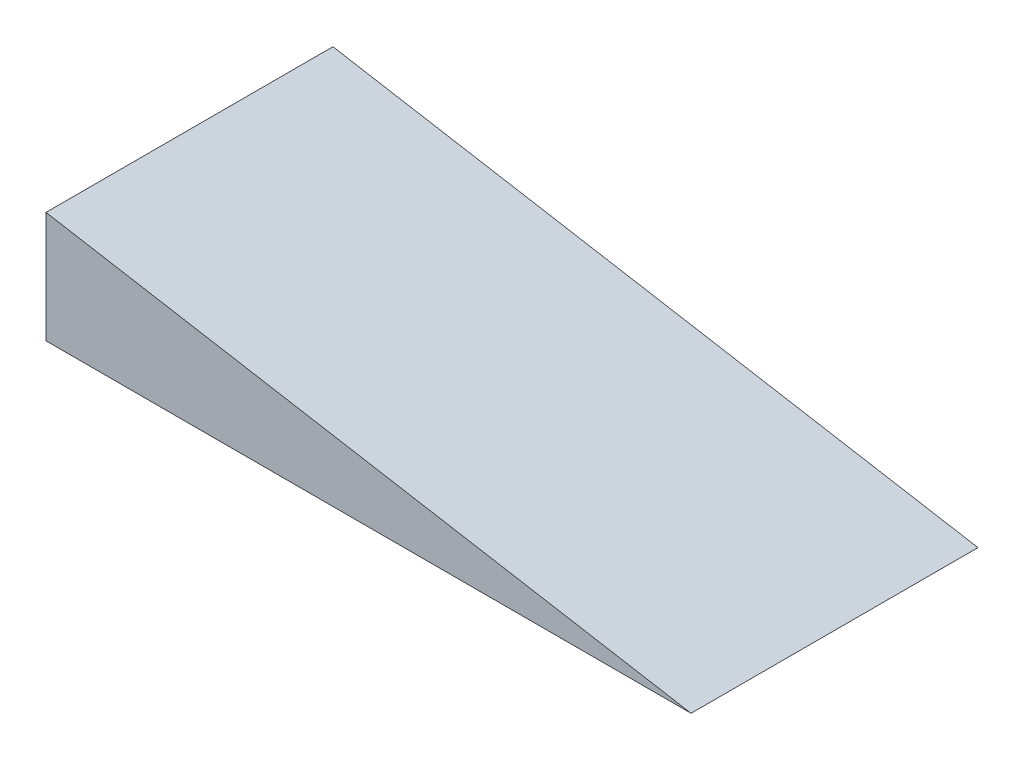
ISO-10303-21;
HEADER;
FILE_DESCRIPTION(('STEP AP214'),'2;1');
FILE_NAME('part.step','',(''),(''),'','','');
FILE_SCHEMA(('AUTOMOTIVE_DESIGN { 1 0 10303 214 1 1 1 1 }'));
ENDSEC;
DATA;
#1=APPLICATION_CONTEXT('core data for automotive mechanical design processes');
#2=APPLICATION_PROTOCOL_DEFINITION('international standard','automotive_design',2000,#1);
#3=PRODUCT_CONTEXT('',#1,'mechanical');
#4=PRODUCT('Part','Part','',(#3));
#5=PRODUCT_RELATED_PRODUCT_CATEGORY('part','',(#4));
#6=PRODUCT_DEFINITION_FORMATION('','',#4);
#7=PRODUCT_DEFINITION_CONTEXT('part definition',#1,'design');
#8=PRODUCT_DEFINITION('design','',#6,#7);
#9=PRODUCT_DEFINITION_SHAPE('','',#8);
#10=(LENGTH_UNIT() NAMED_UNIT(*) SI_UNIT(.MILLI.,.METRE.));
#11=(NAMED_UNIT(*) PLANE_ANGLE_UNIT() SI_UNIT($,.RADIAN.));
#12=(NAMED_UNIT(*) SI_UNIT($,.STERADIAN.) SOLID_ANGLE_UNIT());
#13=UNCERTAINTY_MEASURE_WITH_UNIT(LENGTH_MEASURE(1.E-05),#10,'distance_accuracy_value','');
#14=(GEOMETRIC_REPRESENTATION_CONTEXT(3) GLOBAL_UNCERTAINTY_ASSIGNED_CONTEXT((#13)) GLOBAL_UNIT_ASSIGNED_CONTEXT((#10,
#11,#12)) REPRESENTATION_CONTEXT('',''));
#15=CARTESIAN_POINT('',(0.,0.,0.));
#16=DIRECTION('',(0.,0.,1.));
#17=DIRECTION('',(1.,0.,0.));
#18=AXIS2_PLACEMENT_3D('',#15,#16,#17);
#19=CARTESIAN_POINT('',(440.340644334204,-27.1942342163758,-159.));
#20=DIRECTION('',(0.,-1.,0.));
#21=DIRECTION('',(1.,0.,0.));
#22=AXIS2_PLACEMENT_3D('',#19,#20,#21);
#23=PLANE('',#22);
#24=DIRECTION('',(0.,0.,1.));
#25=VECTOR('',#24,1.);
#26=CARTESIAN_POINT('',(440.340644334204,-27.1942342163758,-159.));
#27=LINE('',#26,#25);
#28=CARTESIAN_POINT('',(440.340644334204,-27.1942342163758,-159.));
#29=VERTEX_POINT('',#28);
#30=CARTESIAN_POINT('',(440.340644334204,-27.1942342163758,99.9999999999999));
#31=VERTEX_POINT('',#30);
#32=EDGE_CURVE('E37',#29,#31,#27,.T.);
#33=ORIENTED_EDGE('',*,*,#32,.T.);
#34=DIRECTION('',(1.,0.,0.));
#35=VECTOR('',#34,1.);
#36=CARTESIAN_POINT('',(440.340644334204,-27.1942342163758,99.9999999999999));
#37=LINE('',#36,#35);
#38=CARTESIAN_POINT('',(-141.954262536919,-27.1942342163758,99.9999999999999));
#39=VERTEX_POINT('',#38);
#40=EDGE_CURVE('E68',#39,#31,#37,.T.);
#41=ORIENTED_EDGE('',*,*,#40,.F.);
#42=DIRECTION('',(0.,0.,1.));
#43=VECTOR('',#42,1.);
#44=CARTESIAN_POINT('',(-141.954262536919,-27.1942342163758,-159.));
#45=LINE('',#44,#43);
#46=CARTESIAN_POINT('',(-141.954262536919,-27.1942342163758,-159.));
#47=VERTEX_POINT('',#46);
#48=EDGE_CURVE('E11',#47,#39,#45,.T.);
#49=ORIENTED_EDGE('',*,*,#48,.F.);
#50=DIRECTION('',(1.,0.,0.));
#51=VECTOR('',#50,1.);
#52=CARTESIAN_POINT('',(440.340644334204,-27.1942342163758,-159.));
#53=LINE('',#52,#51);
#54=EDGE_CURVE('E69',#47,#29,#53,.T.);
#55=ORIENTED_EDGE('',*,*,#54,.T.);
#56=EDGE_LOOP('',(#33,#41,#49,#55));
#57=FACE_BOUND('',#56,.T.);
#58=ADVANCED_FACE('F34',(#57),#23,.T.);
#59=CARTESIAN_POINT('',(-141.954262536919,-27.1942342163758,-159.));
#60=DIRECTION('',(-1.,0.,0.));
#61=DIRECTION('',(0.,0.,1.));
#62=AXIS2_PLACEMENT_3D('',#59,#60,#61);
#63=PLANE('',#62);
#64=ORIENTED_EDGE('',*,*,#48,.T.);
#65=DIRECTION('',(0.,-1.,0.));
#66=VECTOR('',#65,1.);
#67=CARTESIAN_POINT('',(-141.954262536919,-27.1942342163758,99.9999999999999));
#68=LINE('',#67,#66);
#69=CARTESIAN_POINT('',(-141.954262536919,73.2453891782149,99.9999999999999));
#70=VERTEX_POINT('',#69);
#71=EDGE_CURVE('E78',#70,#39,#68,.T.);
#72=ORIENTED_EDGE('',*,*,#71,.F.);
#73=DIRECTION('',(0.,0.,1.));
#74=VECTOR('',#73,1.);
#75=CARTESIAN_POINT('',(-141.954262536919,73.2453891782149,-159.));
#76=LINE('',#75,#74);
#77=CARTESIAN_POINT('',(-141.954262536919,73.2453891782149,-159.));
#78=VERTEX_POINT('',#77);
#79=EDGE_CURVE('E42',#78,#70,#76,.T.);
#80=ORIENTED_EDGE('',*,*,#79,.F.);
#81=DIRECTION('',(0.,-1.,0.));
#82=VECTOR('',#81,1.);
#83=CARTESIAN_POINT('',(-141.954262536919,-27.1942342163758,-159.));
#84=LINE('',#83,#82);
#85=EDGE_CURVE('E72',#78,#47,#84,.T.);
#86=ORIENTED_EDGE('',*,*,#85,.T.);
#87=EDGE_LOOP('',(#64,#72,#80,#86));
#88=FACE_BOUND('',#87,.T.);
#89=ADVANCED_FACE('F88',(#88),#63,.T.);
#90=CARTESIAN_POINT('',(-141.954262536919,73.2453891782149,-159.));
#91=DIRECTION('',(0.16997914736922,0.985447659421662,0.));
#92=DIRECTION('',(-0.985447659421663,0.16997914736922,0.));
#93=AXIS2_PLACEMENT_3D('',#90,#91,#92);
#94=PLANE('',#93);
#95=ORIENTED_EDGE('',*,*,#79,.T.);
#96=DIRECTION('',(-0.985447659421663,0.16997914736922,0.));
#97=VECTOR('',#96,1.);
#98=CARTESIAN_POINT('',(-141.954262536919,73.2453891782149,99.9999999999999));
#99=LINE('',#98,#97);
#100=EDGE_CURVE('E74',#31,#70,#99,.T.);
#101=ORIENTED_EDGE('',*,*,#100,.F.);
#102=ORIENTED_EDGE('',*,*,#32,.F.);
#103=DIRECTION('',(-0.985447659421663,0.16997914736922,0.));
#104=VECTOR('',#103,1.);
#105=CARTESIAN_POINT('',(-141.954262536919,73.2453891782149,-159.));
#106=LINE('',#105,#104);
#107=EDGE_CURVE('E85',#29,#78,#106,.T.);
#108=ORIENTED_EDGE('',*,*,#107,.T.);
#109=EDGE_LOOP('',(#95,#101,#102,#108));
#110=FACE_BOUND('',#109,.T.);
#111=ADVANCED_FACE('F75',(#110),#94,.T.);
#112=CARTESIAN_POINT('',(0.,0.,-159.));
#113=DIRECTION('',(0.,0.,-1.));
#114=DIRECTION('',(-1.,0.,0.));
#115=AXIS2_PLACEMENT_3D('',#112,#113,#114);
#116=PLANE('',#115);
#117=ORIENTED_EDGE('',*,*,#54,.F.);
#118=ORIENTED_EDGE('',*,*,#85,.F.);
#119=ORIENTED_EDGE('',*,*,#107,.F.);
#120=EDGE_LOOP('',(#117,#118,#119));
#121=FACE_BOUND('',#120,.T.);
#122=ADVANCED_FACE('F90',(#121),#116,.T.);
#123=CARTESIAN_POINT('',(0.,0.,99.9999999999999));
#124=DIRECTION('',(0.,0.,-1.));
#125=DIRECTION('',(-1.,0.,0.));
#126=AXIS2_PLACEMENT_3D('',#123,#124,#125);
#127=PLANE('',#126);
#128=ORIENTED_EDGE('',*,*,#40,.T.);
#129=ORIENTED_EDGE('',*,*,#100,.T.);
#130=ORIENTED_EDGE('',*,*,#71,.T.);
#131=EDGE_LOOP('',(#128,#129,#130));
#132=FACE_BOUND('',#131,.T.);
#133=ADVANCED_FACE('F80',(#132),#127,.F.);
#134=CLOSED_SHELL('',(#58,#89,#111,#122,#133));
#135=MANIFOLD_SOLID_BREP('B2',#134);
#136=ADVANCED_BREP_SHAPE_REPRESENTATION('',(#18,#135),#14);
#137=SHAPE_DEFINITION_REPRESENTATION(#9,#136);
ENDSEC;
END-ISO-10303-21;
